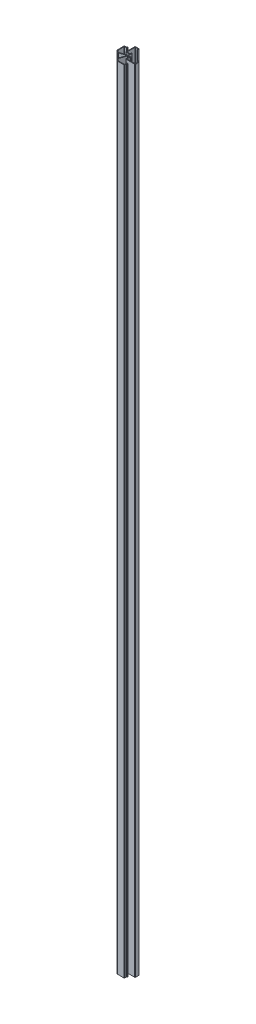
from build123d import *

# Parameters (mm, degrees)
BOSS_EXTRU_1_DEPTH = 1100
CONG_1_R           = 0.5


with BuildPart() as part:
    # Esquisse1 → Boss.-Extru.1 (new body)
    with BuildSketch(Plane(origin=(0, 0, 0), x_dir=(1, 0, 0), z_dir=(0, 1, 0))):
        with BuildLine():
            Line((0, 0), (5.25, 0))
            ThreePointArc((5.25, 0), (5.462132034, -0.087867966), (5.55, -0.3))
            Line((5.55, -0.3), (5.55, -0.55))
            ThreePointArc((5.55, -0.55), (5.462132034, -0.762132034), (5.25, -0.85))
            Line((5.25, -0.85), (3.75, -0.85))
            ThreePointArc((3.75, -0.85), (3.396446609, -0.996446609), (3.25, -1.35))
            Line((3.25, -1.35), (3.25, -4.75))
            ThreePointArc((3.25, -4.75), (3.396446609, -5.103553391), (3.75, -5.25))
            Line((3.75, -5.25), (14.15, -5.25))
            ThreePointArc((14.15, -5.25), (14.503553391, -5.103553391), (14.65, -4.75))
            Line((14.65, -4.75), (14.65, -1.35))
            ThreePointArc((14.65, -1.35), (14.503553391, -0.996446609), (14.15, -0.85))
            Line((14.15, -0.85), (12.65, -0.85))
            ThreePointArc((12.65, -0.85), (12.437867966, -0.762132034), (12.35, -0.55))
            Line((12.35, -0.55), (12.35, -0.3))
            ThreePointArc((12.35, -0.3), (12.437867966, -0.087867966), (12.65, 0))
            Line((12.65, 0), (14.7, 0))
            ThreePointArc((14.7, 0), (15.265685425, -0.234314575), (15.5, -0.8))
            Line((15.5, -0.8), (15.5, -5.3))
            ThreePointArc((15.5, -5.3), (15.265685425, -5.865685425), (14.7, -6.1))
            Line((14.7, -6.1), (3.197, -6.1))
            ThreePointArc((3.197, -6.1), (2.631314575, -5.865685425), (2.397, -5.3))
            Line((2.397, -5.3), (2.397, -1.35))
            ThreePointArc((2.397, -1.35), (2.250553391, -0.996446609), (1.897, -0.85))
            Line((1.897, -0.85), (0.534636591, -0.85))
            ThreePointArc((0.534636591, -0.85), (0.247848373, -0.940423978), (0.064790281, -1.178989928))
            Line((0.064790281, -1.178989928), (-3.491054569, -10.94859336))
            ThreePointArc((-3.491054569, -10.94859336), (-3.509356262, -11.227823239), (-3.374761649, -11.473156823))
            Line((-3.374761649, -11.473156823), (-1.444365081, -13.403553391))
            ThreePointArc((-1.444365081, -13.403553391), (-1.282153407, -13.511939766), (-1.090811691, -13.55))
            Line((-1.090811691, -13.55), (7.5, -13.55))
            ThreePointArc((7.5, -13.55), (7.853553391, -13.403553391), (8, -13.05))
            Line((8, -13.05), (8, -10.9))
            ThreePointArc((8, -10.9), (8.234314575, -10.334314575), (8.8, -10.1))
            Line((8.8, -10.1), (9.7, -10.1))
            ThreePointArc((9.7, -10.1), (9.912132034, -10.187867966), (10, -10.4))
            Line((10, -10.4), (10, -10.65))
            ThreePointArc((10, -10.65), (9.912132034, -10.862132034), (9.7, -10.95))
            Line((9.7, -10.95), (9.35, -10.95))
            ThreePointArc((9.35, -10.95), (8.996446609, -11.096446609), (8.85, -11.45))
            Line((8.85, -11.45), (8.85, -13.6))
            ThreePointArc((8.85, -13.6), (8.615685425, -14.165685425), (8.05, -14.4))
            Line((8.05, -14.4), (-0.407359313, -14.4))
            ThreePointArc((-0.407359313, -14.4), (-1.55540961, -14.171638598), (-2.528679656, -13.521320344))
            Line((-2.528679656, -13.521320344), (-8.025, -8.025))
            Line((-8.025, -8.025), (-13.521320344, -2.528679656))
            ThreePointArc((-13.521320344, -2.528679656), (-14.171638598, -1.55540961), (-14.4, -0.407359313))
            Line((-14.4, -0.407359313), (-14.4, 8.05))
            ThreePointArc((-14.4, 8.05), (-14.165685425, 8.615685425), (-13.6, 8.85))
            Line((-13.6, 8.85), (-11.45, 8.85))
            ThreePointArc((-11.45, 8.85), (-11.096446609, 8.996446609), (-10.95, 9.35))
            Line((-10.95, 9.35), (-10.95, 9.7))
            ThreePointArc((-10.95, 9.7), (-10.862132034, 9.912132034), (-10.65, 10))
            Line((-10.65, 10), (-10.4, 10))
            ThreePointArc((-10.4, 10), (-10.187867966, 9.912132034), (-10.1, 9.7))
            Line((-10.1, 9.7), (-10.1, 8.8))
            ThreePointArc((-10.1, 8.8), (-10.334314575, 8.234314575), (-10.9, 8))
            Line((-10.9, 8), (-13.05, 8))
            ThreePointArc((-13.05, 8), (-13.403553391, 7.853553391), (-13.55, 7.5))
            Line((-13.55, 7.5), (-13.55, -1.090811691))
            ThreePointArc((-13.55, -1.090811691), (-13.511939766, -1.282153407), (-13.403553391, -1.444365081))
            Line((-13.403553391, -1.444365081), (-11.473156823, -3.374761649))
            ThreePointArc((-11.473156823, -3.374761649), (-11.227823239, -3.509356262), (-10.94859336, -3.491054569))
            Line((-10.94859336, -3.491054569), (-1.178989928, 0.064790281))
            ThreePointArc((-1.178989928, 0.064790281), (-0.940423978, 0.247848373), (-0.85, 0.534636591))
            Line((-0.85, 0.534636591), (-0.85, 1.897))
            ThreePointArc((-0.85, 1.897), (-0.996446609, 2.250553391), (-1.35, 2.397))
            Line((-1.35, 2.397), (-5.3, 2.397))
            ThreePointArc((-5.3, 2.397), (-5.865685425, 2.631314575), (-6.1, 3.197))
            Line((-6.1, 3.197), (-6.1, 14.7))
            ThreePointArc((-6.1, 14.7), (-5.865685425, 15.265685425), (-5.3, 15.5))
            Line((-5.3, 15.5), (-0.8, 15.5))
            ThreePointArc((-0.8, 15.5), (-0.234314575, 15.265685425), (0, 14.7))
            Line((0, 14.7), (0, 12.65))
            ThreePointArc((0, 12.65), (-0.087867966, 12.437867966), (-0.3, 12.35))
            Line((-0.3, 12.35), (-0.55, 12.35))
            ThreePointArc((-0.55, 12.35), (-0.762132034, 12.437867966), (-0.85, 12.65))
            Line((-0.85, 12.65), (-0.85, 14.15))
            ThreePointArc((-0.85, 14.15), (-0.996446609, 14.503553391), (-1.35, 14.65))
            Line((-1.35, 14.65), (-4.75, 14.65))
            ThreePointArc((-4.75, 14.65), (-5.103553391, 14.503553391), (-5.25, 14.15))
            Line((-5.25, 14.15), (-5.25, 3.75))
            ThreePointArc((-5.25, 3.75), (-5.103553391, 3.396446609), (-4.75, 3.25))
            Line((-4.75, 3.25), (-1.35, 3.25))
            ThreePointArc((-1.35, 3.25), (-0.996446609, 3.396446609), (-0.85, 3.75))
            Line((-0.85, 3.75), (-0.85, 5.25))
            ThreePointArc((-0.85, 5.25), (-0.762132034, 5.462132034), (-0.55, 5.55))
            Line((-0.55, 5.55), (-0.3, 5.55))
            ThreePointArc((-0.3, 5.55), (-0.087867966, 5.462132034), (0, 5.25))
            Line((0, 5.25), (0, 0))
        make_face()
        with BuildLine():
            Line((-9.847232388, -3.994743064), (-0.645635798, -0.645635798))
            Line((-0.645635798, -0.645635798), (-3.994743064, -9.847232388))
            ThreePointArc((-3.994743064, -9.847232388), (-4.356369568, -10.16437032), (-4.818142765, -10.029775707))
            Line((-4.818142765, -10.029775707), (-7.423959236, -7.423959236))
            Line((-7.423959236, -7.423959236), (-10.029775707, -4.818142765))
            ThreePointArc((-10.029775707, -4.818142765), (-10.16437032, -4.356369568), (-9.847232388, -3.994743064))
        make_face(mode=Mode.SUBTRACT)
    extrude(amount=BOSS_EXTRU_1_DEPTH)

    # Cong_1
    cong_1_edges = [part.edges().sort_by_distance(p)[0] for p in [
        (-0.645635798, 550, 0.645635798),
    ]]
    fillet(cong_1_edges, radius=CONG_1_R)


solid = part.part
